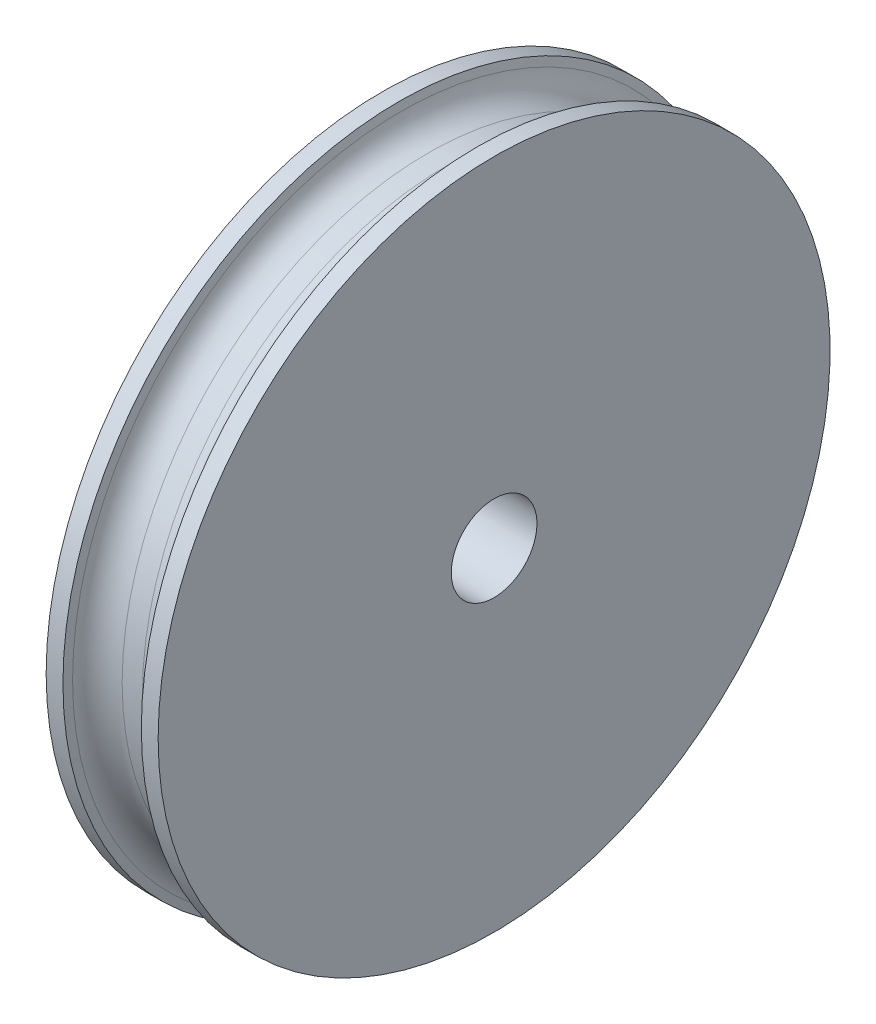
ISO-10303-21;
HEADER;
FILE_DESCRIPTION(('STEP AP214'),'2;1');
FILE_NAME('part.step','',(''),(''),'','','');
FILE_SCHEMA(('AUTOMOTIVE_DESIGN { 1 0 10303 214 1 1 1 1 }'));
ENDSEC;
DATA;
#1=APPLICATION_CONTEXT('core data for automotive mechanical design processes');
#2=APPLICATION_PROTOCOL_DEFINITION('international standard','automotive_design',2000,#1);
#3=PRODUCT_CONTEXT('',#1,'mechanical');
#4=PRODUCT('Part','Part','',(#3));
#5=PRODUCT_RELATED_PRODUCT_CATEGORY('part','',(#4));
#6=PRODUCT_DEFINITION_FORMATION('','',#4);
#7=PRODUCT_DEFINITION_CONTEXT('part definition',#1,'design');
#8=PRODUCT_DEFINITION('design','',#6,#7);
#9=PRODUCT_DEFINITION_SHAPE('','',#8);
#10=(LENGTH_UNIT() NAMED_UNIT(*) SI_UNIT(.MILLI.,.METRE.));
#11=(NAMED_UNIT(*) PLANE_ANGLE_UNIT() SI_UNIT($,.RADIAN.));
#12=(NAMED_UNIT(*) SI_UNIT($,.STERADIAN.) SOLID_ANGLE_UNIT());
#13=UNCERTAINTY_MEASURE_WITH_UNIT(LENGTH_MEASURE(1.E-05),#10,'distance_accuracy_value','');
#14=(GEOMETRIC_REPRESENTATION_CONTEXT(3) GLOBAL_UNCERTAINTY_ASSIGNED_CONTEXT((#13)) GLOBAL_UNIT_ASSIGNED_CONTEXT((#10,
#11,#12)) REPRESENTATION_CONTEXT('',''));
#15=CARTESIAN_POINT('',(0.,0.,0.));
#16=DIRECTION('',(0.,0.,1.));
#17=DIRECTION('',(1.,0.,0.));
#18=AXIS2_PLACEMENT_3D('',#15,#16,#17);
#19=CARTESIAN_POINT('',(-1.1712000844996,0.117251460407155,0.));
#20=DIRECTION('',(-1.,0.,0.));
#21=DIRECTION('',(0.,0.,1.));
#22=AXIS2_PLACEMENT_3D('',#19,#20,#21);
#23=CONICAL_SURFACE('',#22,10.9240376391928,1.36135681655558);
#24=CARTESIAN_POINT('',(-1.33956365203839,0.117251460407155,0.));
#25=DIRECTION('',(-1.,0.,0.));
#26=DIRECTION('',(0.,0.,1.));
#27=AXIS2_PLACEMENT_3D('',#24,#25,#26);
#28=CIRCLE('',#27,11.7161259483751);
#29=CARTESIAN_POINT('',(-1.33956365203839,0.117251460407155,11.7161259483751));
#30=VERTEX_POINT('',#29);
#31=EDGE_CURVE('E56',#30,#30,#28,.T.);
#32=ORIENTED_EDGE('',*,*,#31,.T.);
#33=EDGE_LOOP('',(#32));
#34=FACE_BOUND('',#33,.T.);
#35=CARTESIAN_POINT('',(-1.39990294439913,0.117251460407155,0.));
#36=DIRECTION('',(-1.,0.,0.));
#37=DIRECTION('',(0.,0.,1.));
#38=AXIS2_PLACEMENT_3D('',#35,#36,#37);
#39=CIRCLE('',#38,12.);
#40=CARTESIAN_POINT('',(-1.39990294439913,0.117251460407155,12.));
#41=VERTEX_POINT('',#40);
#42=EDGE_CURVE('E59',#41,#41,#39,.T.);
#43=ORIENTED_EDGE('',*,*,#42,.F.);
#44=EDGE_LOOP('',(#43));
#45=FACE_BOUND('',#44,.T.);
#46=ADVANCED_FACE('F33',(#34,#45),#23,.T.);
#47=CARTESIAN_POINT('',(-22.6859186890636,0.117251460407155,0.));
#48=DIRECTION('',(-1.,0.,0.));
#49=DIRECTION('',(0.,0.,1.));
#50=AXIS2_PLACEMENT_3D('',#47,#48,#49);
#51=CYLINDRICAL_SURFACE('',#50,12.);
#52=CARTESIAN_POINT('',(-1.99990294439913,0.117251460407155,0.));
#53=DIRECTION('',(-1.,0.,0.));
#54=DIRECTION('',(0.,0.,1.));
#55=AXIS2_PLACEMENT_3D('',#52,#53,#54);
#56=CIRCLE('',#55,12.);
#57=CARTESIAN_POINT('',(-1.99990294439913,0.117251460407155,12.));
#58=VERTEX_POINT('',#57);
#59=EDGE_CURVE('E62',#58,#58,#56,.T.);
#60=ORIENTED_EDGE('',*,*,#59,.F.);
#61=EDGE_LOOP('',(#60));
#62=FACE_BOUND('',#61,.T.);
#63=ORIENTED_EDGE('',*,*,#42,.T.);
#64=EDGE_LOOP('',(#63));
#65=FACE_BOUND('',#64,.T.);
#66=ADVANCED_FACE('F94',(#62,#65),#51,.T.);
#67=CARTESIAN_POINT('',(-1.99990294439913,0.117251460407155,0.));
#68=DIRECTION('',(1.,0.,0.));
#69=DIRECTION('',(0.,0.,-1.));
#70=AXIS2_PLACEMENT_3D('',#67,#68,#69);
#71=PLANE('',#70);
#72=CARTESIAN_POINT('',(-1.99990294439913,0.,0.));
#73=DIRECTION('',(1.,0.,0.));
#74=DIRECTION('',(0.,0.,-1.));
#75=AXIS2_PLACEMENT_3D('',#72,#73,#74);
#76=CIRCLE('',#75,4.5);
#77=CARTESIAN_POINT('',(-1.99990294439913,0.,-4.5));
#78=VERTEX_POINT('',#77);
#79=EDGE_CURVE('E40',#78,#78,#76,.F.);
#80=ORIENTED_EDGE('',*,*,#79,.F.);
#81=EDGE_LOOP('',(#80));
#82=FACE_BOUND('',#81,.T.);
#83=ORIENTED_EDGE('',*,*,#59,.T.);
#84=EDGE_LOOP('',(#83));
#85=FACE_BOUND('',#84,.T.);
#86=ADVANCED_FACE('F100',(#82,#85),#71,.F.);
#87=CARTESIAN_POINT('',(2.00009705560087,12.1172514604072,0.));
#88=DIRECTION('',(-1.,0.,0.));
#89=DIRECTION('',(0.,0.,1.));
#90=AXIS2_PLACEMENT_3D('',#87,#88,#89);
#91=PLANE('',#90);
#92=CARTESIAN_POINT('',(2.00009705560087,0.,0.));
#93=DIRECTION('',(-1.,0.,0.));
#94=DIRECTION('',(0.,0.,1.));
#95=AXIS2_PLACEMENT_3D('',#92,#93,#94);
#96=CIRCLE('',#95,1.53);
#97=CARTESIAN_POINT('',(2.00009705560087,0.,1.53));
#98=VERTEX_POINT('',#97);
#99=EDGE_CURVE('E71',#98,#98,#96,.T.);
#100=ORIENTED_EDGE('',*,*,#99,.T.);
#101=EDGE_LOOP('',(#100));
#102=FACE_BOUND('',#101,.T.);
#103=CARTESIAN_POINT('',(2.00009705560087,0.117251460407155,0.));
#104=DIRECTION('',(-1.,0.,0.));
#105=DIRECTION('',(0.,0.,1.));
#106=AXIS2_PLACEMENT_3D('',#103,#104,#105);
#107=CIRCLE('',#106,12.);
#108=CARTESIAN_POINT('',(2.00009705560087,0.117251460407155,12.));
#109=VERTEX_POINT('',#108);
#110=EDGE_CURVE('E65',#109,#109,#107,.T.);
#111=ORIENTED_EDGE('',*,*,#110,.F.);
#112=EDGE_LOOP('',(#111));
#113=FACE_BOUND('',#112,.T.);
#114=ADVANCED_FACE('F129',(#102,#113),#91,.F.);
#115=CARTESIAN_POINT('',(-22.6859186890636,0.117251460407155,0.));
#116=DIRECTION('',(-1.,0.,0.));
#117=DIRECTION('',(0.,0.,1.));
#118=AXIS2_PLACEMENT_3D('',#115,#116,#117);
#119=CYLINDRICAL_SURFACE('',#118,12.);
#120=CARTESIAN_POINT('',(1.40009705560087,0.117251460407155,0.));
#121=DIRECTION('',(-1.,0.,0.));
#122=DIRECTION('',(0.,0.,1.));
#123=AXIS2_PLACEMENT_3D('',#120,#121,#122);
#124=CIRCLE('',#123,12.);
#125=CARTESIAN_POINT('',(1.40009705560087,0.117251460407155,12.));
#126=VERTEX_POINT('',#125);
#127=EDGE_CURVE('E68',#126,#126,#124,.T.);
#128=ORIENTED_EDGE('',*,*,#127,.F.);
#129=EDGE_LOOP('',(#128));
#130=FACE_BOUND('',#129,.T.);
#131=ORIENTED_EDGE('',*,*,#110,.T.);
#132=EDGE_LOOP('',(#131));
#133=FACE_BOUND('',#132,.T.);
#134=ADVANCED_FACE('F123',(#130,#133),#119,.T.);
#135=CARTESIAN_POINT('',(1.40009705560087,0.117251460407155,0.));
#136=DIRECTION('',(1.,0.,0.));
#137=DIRECTION('',(0.,0.,-1.));
#138=AXIS2_PLACEMENT_3D('',#135,#136,#137);
#139=CONICAL_SURFACE('',#138,12.,1.36135681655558);
#140=CARTESIAN_POINT('',(1.33975776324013,0.117251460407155,0.));
#141=DIRECTION('',(1.,0.,0.));
#142=DIRECTION('',(0.,0.,-1.));
#143=AXIS2_PLACEMENT_3D('',#140,#141,#142);
#144=CIRCLE('',#143,11.7161259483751);
#145=CARTESIAN_POINT('',(1.33975776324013,0.117251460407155,-11.7161259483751));
#146=VERTEX_POINT('',#145);
#147=EDGE_CURVE('E44',#146,#146,#144,.T.);
#148=ORIENTED_EDGE('',*,*,#147,.T.);
#149=EDGE_LOOP('',(#148));
#150=FACE_BOUND('',#149,.T.);
#151=ORIENTED_EDGE('',*,*,#127,.T.);
#152=EDGE_LOOP('',(#151));
#153=FACE_BOUND('',#152,.T.);
#154=ADVANCED_FACE('F112',(#150,#153),#139,.T.);
#155=CARTESIAN_POINT('',(-22.6859186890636,0.117251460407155,0.));
#156=DIRECTION('',(-1.,0.,0.));
#157=DIRECTION('',(0.,0.,1.));
#158=AXIS2_PLACEMENT_3D('',#155,#156,#157);
#159=CYLINDRICAL_SURFACE('',#158,10.9240376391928);
#160=CARTESIAN_POINT('',(-0.361416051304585,0.117251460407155,0.));
#161=DIRECTION('',(-1.,0.,0.));
#162=DIRECTION('',(0.,0.,1.));
#163=AXIS2_PLACEMENT_3D('',#160,#161,#162);
#164=CIRCLE('',#163,10.9240376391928);
#165=CARTESIAN_POINT('',(-0.361416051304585,0.117251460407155,10.9240376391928));
#166=VERTEX_POINT('',#165);
#167=EDGE_CURVE('E48',#166,#166,#164,.F.);
#168=ORIENTED_EDGE('',*,*,#167,.T.);
#169=EDGE_LOOP('',(#168));
#170=FACE_BOUND('',#169,.T.);
#171=CARTESIAN_POINT('',(0.361610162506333,0.117251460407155,0.));
#172=DIRECTION('',(-1.,0.,0.));
#173=DIRECTION('',(0.,0.,1.));
#174=AXIS2_PLACEMENT_3D('',#171,#172,#173);
#175=CIRCLE('',#174,10.9240376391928);
#176=CARTESIAN_POINT('',(0.361610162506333,0.117251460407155,10.9240376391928));
#177=VERTEX_POINT('',#176);
#178=EDGE_CURVE('E53',#177,#177,#175,.T.);
#179=ORIENTED_EDGE('',*,*,#178,.T.);
#180=EDGE_LOOP('',(#179));
#181=FACE_BOUND('',#180,.T.);
#182=ADVANCED_FACE('F107',(#170,#181),#159,.T.);
#183=CARTESIAN_POINT('',(-0.361416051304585,0.117251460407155,0.));
#184=DIRECTION('',(-1.,0.,0.));
#185=DIRECTION('',(0.,0.,1.));
#186=AXIS2_PLACEMENT_3D('',#183,#184,#185);
#187=TOROIDAL_SURFACE('',#186,11.9240376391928,1.);
#188=ORIENTED_EDGE('',*,*,#167,.F.);
#189=EDGE_LOOP('',(#188));
#190=FACE_BOUND('',#189,.T.);
#191=ORIENTED_EDGE('',*,*,#31,.F.);
#192=EDGE_LOOP('',(#191));
#193=FACE_BOUND('',#192,.T.);
#194=ADVANCED_FACE('F90',(#190,#193),#187,.F.);
#195=CARTESIAN_POINT('',(0.361610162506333,0.117251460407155,0.));
#196=DIRECTION('',(-1.,0.,0.));
#197=DIRECTION('',(0.,0.,1.));
#198=AXIS2_PLACEMENT_3D('',#195,#196,#197);
#199=TOROIDAL_SURFACE('',#198,11.9240376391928,1.);
#200=ORIENTED_EDGE('',*,*,#147,.F.);
#201=EDGE_LOOP('',(#200));
#202=FACE_BOUND('',#201,.T.);
#203=ORIENTED_EDGE('',*,*,#178,.F.);
#204=EDGE_LOOP('',(#203));
#205=FACE_BOUND('',#204,.T.);
#206=ADVANCED_FACE('F83',(#202,#205),#199,.F.);
#207=CARTESIAN_POINT('',(-2.49990294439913,0.,0.));
#208=DIRECTION('',(-1.,0.,0.));
#209=DIRECTION('',(0.,0.,1.));
#210=AXIS2_PLACEMENT_3D('',#207,#208,#209);
#211=PLANE('',#210);
#212=CARTESIAN_POINT('',(-2.49990294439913,0.,0.));
#213=DIRECTION('',(-1.,0.,0.));
#214=DIRECTION('',(0.,0.,1.));
#215=AXIS2_PLACEMENT_3D('',#212,#213,#214);
#216=CIRCLE('',#215,4.);
#217=CARTESIAN_POINT('',(-2.49990294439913,0.,4.));
#218=VERTEX_POINT('',#217);
#219=EDGE_CURVE('E10',#218,#218,#216,.T.);
#220=ORIENTED_EDGE('',*,*,#219,.T.);
#221=EDGE_LOOP('',(#220));
#222=FACE_BOUND('',#221,.T.);
#223=CARTESIAN_POINT('',(-2.49990294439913,0.,0.));
#224=DIRECTION('',(-1.,0.,0.));
#225=DIRECTION('',(0.,0.,1.));
#226=AXIS2_PLACEMENT_3D('',#223,#224,#225);
#227=CIRCLE('',#226,1.53);
#228=CARTESIAN_POINT('',(-2.49990294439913,0.,1.53));
#229=VERTEX_POINT('',#228);
#230=EDGE_CURVE('E74',#229,#229,#227,.T.);
#231=ORIENTED_EDGE('',*,*,#230,.F.);
#232=EDGE_LOOP('',(#231));
#233=FACE_BOUND('',#232,.T.);
#234=ADVANCED_FACE('F81',(#222,#233),#211,.T.);
#235=CARTESIAN_POINT('',(3.50009705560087,0.,0.));
#236=DIRECTION('',(-1.,0.,0.));
#237=DIRECTION('',(0.,0.,1.));
#238=AXIS2_PLACEMENT_3D('',#235,#236,#237);
#239=CYLINDRICAL_SURFACE('',#238,1.53);
#240=ORIENTED_EDGE('',*,*,#230,.T.);
#241=EDGE_LOOP('',(#240));
#242=FACE_BOUND('',#241,.T.);
#243=ORIENTED_EDGE('',*,*,#99,.F.);
#244=EDGE_LOOP('',(#243));
#245=FACE_BOUND('',#244,.T.);
#246=ADVANCED_FACE('F78',(#242,#245),#239,.F.);
#247=CARTESIAN_POINT('',(-1.99990294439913,0.,0.));
#248=DIRECTION('',(-1.,0.,0.));
#249=DIRECTION('',(0.,0.,1.));
#250=AXIS2_PLACEMENT_3D('',#247,#248,#249);
#251=TOROIDAL_SURFACE('',#250,4.,0.5);
#252=ORIENTED_EDGE('',*,*,#79,.T.);
#253=EDGE_LOOP('',(#252));
#254=FACE_BOUND('',#253,.T.);
#255=ORIENTED_EDGE('',*,*,#219,.F.);
#256=EDGE_LOOP('',(#255));
#257=FACE_BOUND('',#256,.T.);
#258=ADVANCED_FACE('F35',(#254,#257),#251,.T.);
#259=CLOSED_SHELL('',(#46,#66,#86,#114,#134,#154,#182,#194,#206,#234,#246,#258));
#260=MANIFOLD_SOLID_BREP('B2',#259);
#261=ADVANCED_BREP_SHAPE_REPRESENTATION('',(#18,#260),#14);
#262=SHAPE_DEFINITION_REPRESENTATION(#9,#261);
ENDSEC;
END-ISO-10303-21;
